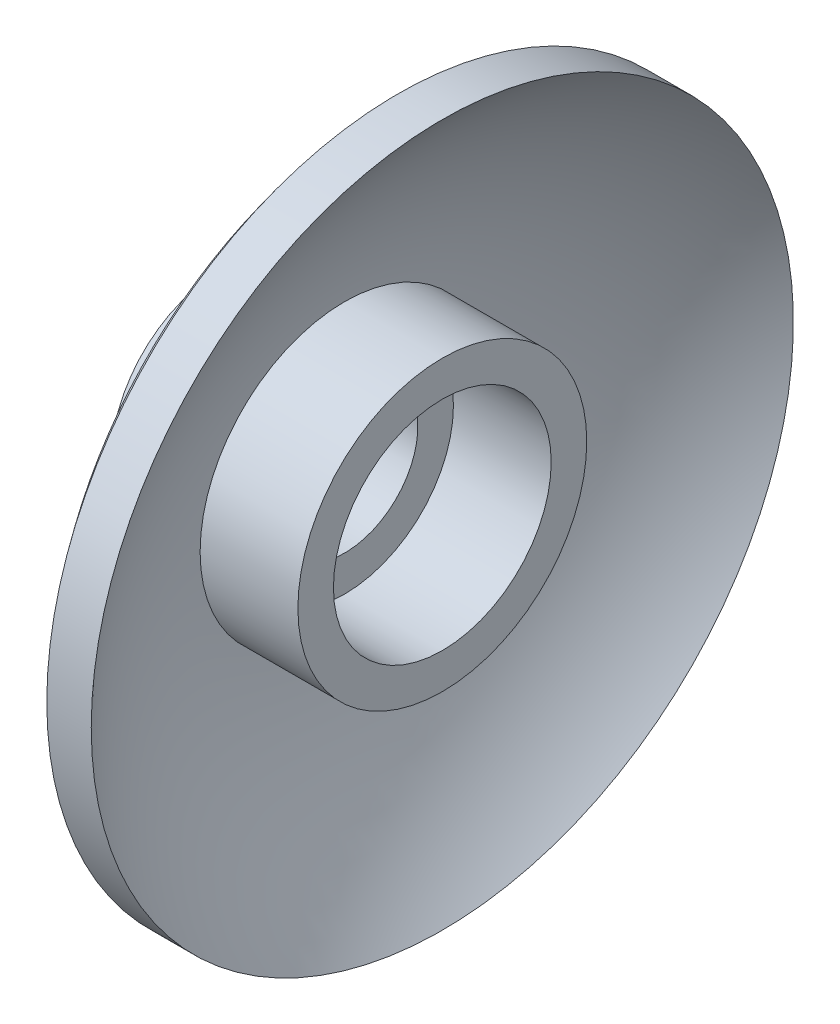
from build123d import *


with BuildPart() as part:
    # Skizze1 → Rotation1 (revolve)
    with BuildSketch(Plane.XY, mode=Mode.PRIVATE) as rotation1_sk:
        with BuildLine():
            Line((17.047391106, 3.25), (17.047391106, 2.45))
            Line((17.047391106, 2.45), (14.847391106, 2.45))
            Line((14.847391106, 2.45), (14.847391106, 1.65))
            Line((14.847391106, 1.65), (12.047391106, 1.65))
            Line((12.047391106, 1.65), (12.047391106, 2.45))
            Line((12.047391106, 2.45), (13.903548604, 2.45))
            ThreePointArc((13.903548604, 2.45), (14.545017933, 5.344324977), (16.047391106, 7.9))
            Line((16.047391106, 7.9), (17.047391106, 7.9))
            ThreePointArc((17.047391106, 7.9), (15.563442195, 5.756653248), (14.847391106, 3.25))
            Line((14.847391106, 3.25), (17.047391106, 3.25))
        make_face()
    revolve(rotation1_sk.sketch.rotate(Axis((0, 0, 0), (1, 0, 0)), 90), axis=Axis((0, 0, 0), (1, 0, 0)))


solid = part.part
